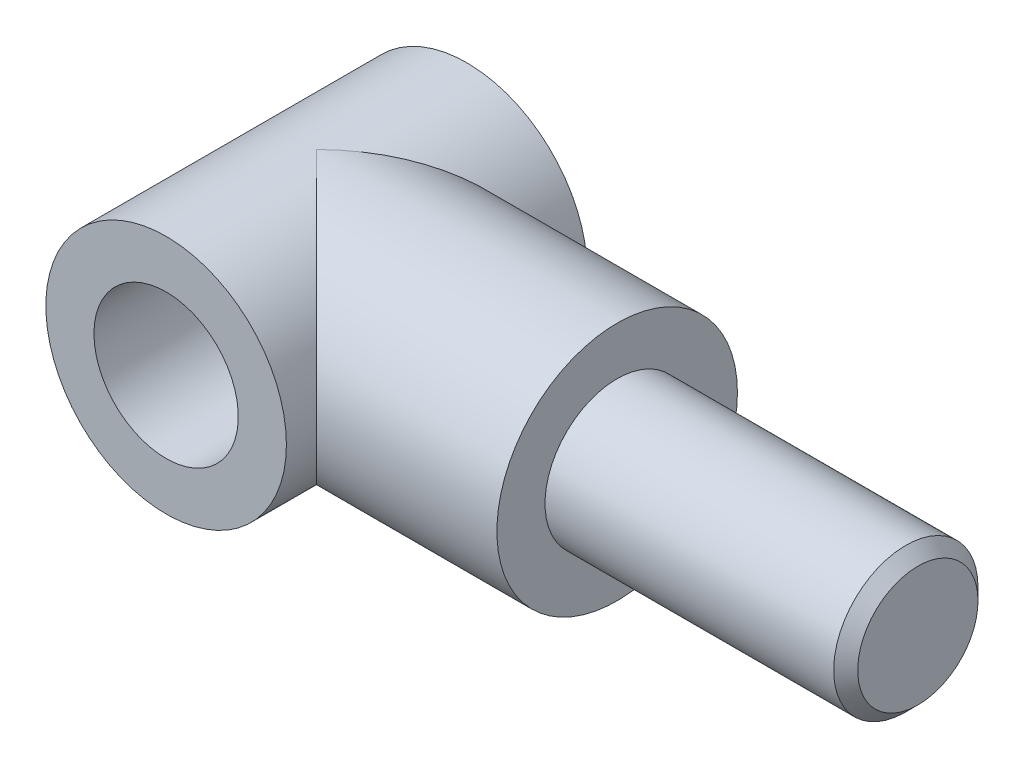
from build123d import *

# Parameters (mm, degrees)
ESQUISSE1_R             = 10
BASE_EXTRUSION_DEPTH    = 25
ESQUISSE2_R             = 10
BOSS_EXTRU_1_DEPTH      = 25
ESQUISSE3_R             = 6
ENL_V_MAT_EXTRU_1_DEPTH = 37.742346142
ESQUISSE4_R             = 6
BOSS_EXTRU_2_DEPTH      = 25
CHANFREIN1_SIZE         = 1


with BuildPart() as part:
    # Esquisse1 → Base-Extrusion (new body)
    with BuildSketch(Plane.XY):
        Circle(ESQUISSE1_R)
    extrude(amount=BASE_EXTRUSION_DEPTH)

    # Esquisse2 → Boss.-Extru.1 (add)
    with BuildSketch(Plane(origin=(0, 0, 0), x_dir=(0, 0, -1), z_dir=(1, 0, 0))):
        with Locations((-12.5, 0)):
            Circle(ESQUISSE2_R)
    extrude(amount=BOSS_EXTRU_1_DEPTH)

    # Esquisse3 → Enl_v. mat.-Extru.1 (cut, through all)
    with BuildSketch(Plane(origin=(0, 0, 0), x_dir=(-1, 0, 0), z_dir=(0, 0, -1))):
        Circle(ESQUISSE3_R)
    extrude(amount=-ENL_V_MAT_EXTRU_1_DEPTH, mode=Mode.SUBTRACT)

    # Esquisse4 → Boss.-Extru.2 (add)
    with BuildSketch(Plane(origin=(25, 0, 0), x_dir=(0, 0, -1), z_dir=(1, 0, 0))):
        with Locations((-12.5, 0)):
            Circle(ESQUISSE4_R)
    extrude(amount=BOSS_EXTRU_2_DEPTH)

    # Chanfrein1
    chanfrein1_edges = [part.edges().sort_by_distance(p)[0] for p in [
        (50, 0, 18.5),
    ]]
    chamfer(chanfrein1_edges, length=CHANFREIN1_SIZE)


solid = part.part
